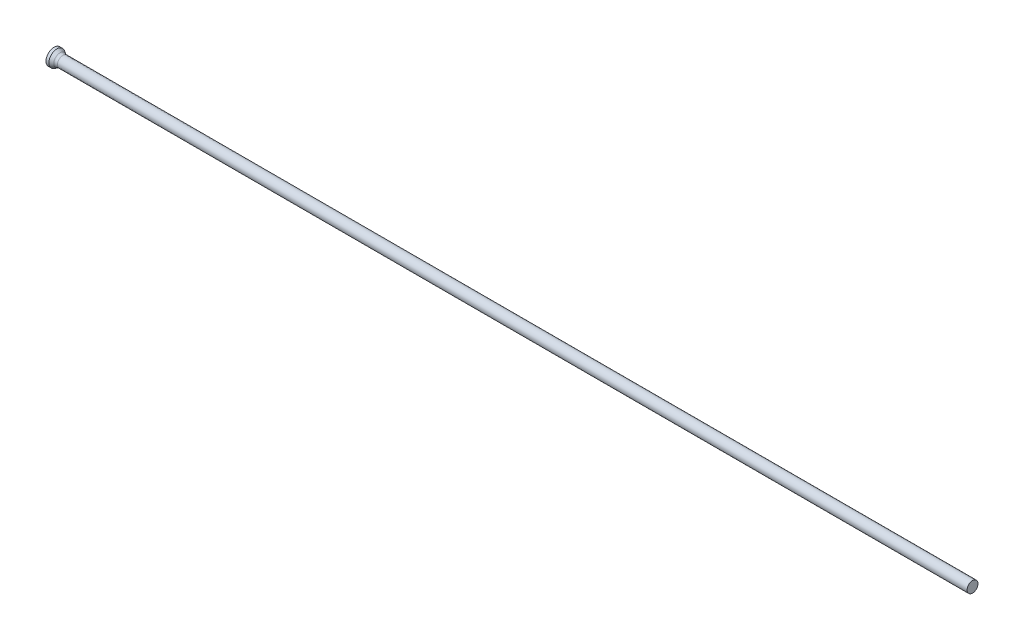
ISO-10303-21;
HEADER;
FILE_DESCRIPTION(('STEP AP214'),'2;1');
FILE_NAME('part.step','',(''),(''),'','','');
FILE_SCHEMA(('AUTOMOTIVE_DESIGN { 1 0 10303 214 1 1 1 1 }'));
ENDSEC;
DATA;
#1=APPLICATION_CONTEXT('core data for automotive mechanical design processes');
#2=APPLICATION_PROTOCOL_DEFINITION('international standard','automotive_design',2000,#1);
#3=PRODUCT_CONTEXT('',#1,'mechanical');
#4=PRODUCT('Part','Part','',(#3));
#5=PRODUCT_RELATED_PRODUCT_CATEGORY('part','',(#4));
#6=PRODUCT_DEFINITION_FORMATION('','',#4);
#7=PRODUCT_DEFINITION_CONTEXT('part definition',#1,'design');
#8=PRODUCT_DEFINITION('design','',#6,#7);
#9=PRODUCT_DEFINITION_SHAPE('','',#8);
#10=(LENGTH_UNIT() NAMED_UNIT(*) SI_UNIT(.MILLI.,.METRE.));
#11=(NAMED_UNIT(*) PLANE_ANGLE_UNIT() SI_UNIT($,.RADIAN.));
#12=(NAMED_UNIT(*) SI_UNIT($,.STERADIAN.) SOLID_ANGLE_UNIT());
#13=UNCERTAINTY_MEASURE_WITH_UNIT(LENGTH_MEASURE(1.E-05),#10,'distance_accuracy_value','');
#14=(GEOMETRIC_REPRESENTATION_CONTEXT(3) GLOBAL_UNCERTAINTY_ASSIGNED_CONTEXT((#13)) GLOBAL_UNIT_ASSIGNED_CONTEXT((#10,
#11,#12)) REPRESENTATION_CONTEXT('',''));
#15=CARTESIAN_POINT('',(0.,0.,0.));
#16=DIRECTION('',(0.,0.,1.));
#17=DIRECTION('',(1.,0.,0.));
#18=AXIS2_PLACEMENT_3D('',#15,#16,#17);
#19=CARTESIAN_POINT('',(0.,0.,0.));
#20=DIRECTION('',(1.,0.,0.));
#21=DIRECTION('',(0.,0.,-1.));
#22=AXIS2_PLACEMENT_3D('',#19,#20,#21);
#23=PLANE('',#22);
#24=CARTESIAN_POINT('',(0.,0.,0.));
#25=DIRECTION('',(-1.,0.,0.));
#26=DIRECTION('',(0.,0.,1.));
#27=AXIS2_PLACEMENT_3D('',#24,#25,#26);
#28=CIRCLE('',#27,1.4);
#29=CARTESIAN_POINT('',(0.,0.,1.4));
#30=VERTEX_POINT('',#29);
#31=EDGE_CURVE('E25',#30,#30,#28,.T.);
#32=ORIENTED_EDGE('',*,*,#31,.T.);
#33=EDGE_LOOP('',(#32));
#34=FACE_BOUND('',#33,.T.);
#35=ADVANCED_FACE('F14',(#34),#23,.F.);
#36=CARTESIAN_POINT('',(0.,0.,0.));
#37=DIRECTION('',(-1.,0.,0.));
#38=DIRECTION('',(0.,0.,1.));
#39=AXIS2_PLACEMENT_3D('',#36,#37,#38);
#40=CYLINDRICAL_SURFACE('',#39,1.4);
#41=ORIENTED_EDGE('',*,*,#31,.F.);
#42=EDGE_LOOP('',(#41));
#43=FACE_BOUND('',#42,.T.);
#44=CARTESIAN_POINT('',(0.500577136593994,0.,0.));
#45=DIRECTION('',(-1.,0.,0.));
#46=DIRECTION('',(0.,0.,1.));
#47=AXIS2_PLACEMENT_3D('',#44,#45,#46);
#48=CIRCLE('',#47,1.4);
#49=CARTESIAN_POINT('',(0.500577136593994,0.,1.4));
#50=VERTEX_POINT('',#49);
#51=EDGE_CURVE('E29',#50,#50,#48,.T.);
#52=ORIENTED_EDGE('',*,*,#51,.T.);
#53=EDGE_LOOP('',(#52));
#54=FACE_BOUND('',#53,.T.);
#55=ADVANCED_FACE('F53',(#43,#54),#40,.T.);
#56=CARTESIAN_POINT('',(1.28,0.,0.));
#57=DIRECTION('',(-1.,0.,0.));
#58=DIRECTION('',(0.,0.,1.));
#59=AXIS2_PLACEMENT_3D('',#56,#57,#58);
#60=CONICAL_SURFACE('',#59,0.95,0.523598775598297);
#61=CARTESIAN_POINT('',(1.04794919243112,0.,0.));
#62=DIRECTION('',(-1.,0.,0.));
#63=DIRECTION('',(0.,0.,1.));
#64=AXIS2_PLACEMENT_3D('',#61,#62,#63);
#65=CIRCLE('',#64,1.08397459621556);
#66=CARTESIAN_POINT('',(1.04794919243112,0.,1.08397459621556));
#67=VERTEX_POINT('',#66);
#68=EDGE_CURVE('E21',#67,#67,#65,.T.);
#69=ORIENTED_EDGE('',*,*,#68,.T.);
#70=EDGE_LOOP('',(#69));
#71=FACE_BOUND('',#70,.T.);
#72=ORIENTED_EDGE('',*,*,#51,.F.);
#73=EDGE_LOOP('',(#72));
#74=FACE_BOUND('',#73,.T.);
#75=ADVANCED_FACE('F50',(#71,#74),#60,.T.);
#76=CARTESIAN_POINT('',(0.,0.,0.));
#77=DIRECTION('',(-1.,0.,0.));
#78=DIRECTION('',(0.,0.,1.));
#79=AXIS2_PLACEMENT_3D('',#76,#77,#78);
#80=CYLINDRICAL_SURFACE('',#79,0.95);
#81=CARTESIAN_POINT('',(1.54794919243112,0.,0.));
#82=DIRECTION('',(-1.,0.,0.));
#83=DIRECTION('',(0.,0.,1.));
#84=AXIS2_PLACEMENT_3D('',#81,#82,#83);
#85=CIRCLE('',#84,0.95);
#86=CARTESIAN_POINT('',(1.54794919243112,0.,0.95));
#87=VERTEX_POINT('',#86);
#88=EDGE_CURVE('E9',#87,#87,#85,.F.);
#89=ORIENTED_EDGE('',*,*,#88,.T.);
#90=EDGE_LOOP('',(#89));
#91=FACE_BOUND('',#90,.T.);
#92=CARTESIAN_POINT('',(160.,0.,0.));
#93=DIRECTION('',(-1.,0.,0.));
#94=DIRECTION('',(0.,0.,1.));
#95=AXIS2_PLACEMENT_3D('',#92,#93,#94);
#96=CIRCLE('',#95,0.95);
#97=CARTESIAN_POINT('',(160.,0.,0.95));
#98=VERTEX_POINT('',#97);
#99=EDGE_CURVE('E34',#98,#98,#96,.T.);
#100=ORIENTED_EDGE('',*,*,#99,.T.);
#101=EDGE_LOOP('',(#100));
#102=FACE_BOUND('',#101,.T.);
#103=ADVANCED_FACE('F38',(#91,#102),#80,.T.);
#104=CARTESIAN_POINT('',(160.,0.95,0.));
#105=DIRECTION('',(-1.,0.,0.));
#106=DIRECTION('',(0.,0.,1.));
#107=AXIS2_PLACEMENT_3D('',#104,#105,#106);
#108=PLANE('',#107);
#109=ORIENTED_EDGE('',*,*,#99,.F.);
#110=EDGE_LOOP('',(#109));
#111=FACE_BOUND('',#110,.T.);
#112=ADVANCED_FACE('F40',(#111),#108,.F.);
#113=CARTESIAN_POINT('',(1.54794919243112,0.,0.));
#114=DIRECTION('',(-1.,0.,0.));
#115=DIRECTION('',(0.,0.,1.));
#116=AXIS2_PLACEMENT_3D('',#113,#114,#115);
#117=TOROIDAL_SURFACE('',#116,1.95,1.);
#118=ORIENTED_EDGE('',*,*,#88,.F.);
#119=EDGE_LOOP('',(#118));
#120=FACE_BOUND('',#119,.T.);
#121=ORIENTED_EDGE('',*,*,#68,.F.);
#122=EDGE_LOOP('',(#121));
#123=FACE_BOUND('',#122,.T.);
#124=ADVANCED_FACE('F16',(#120,#123),#117,.F.);
#125=CLOSED_SHELL('',(#35,#55,#75,#103,#112,#124));
#126=MANIFOLD_SOLID_BREP('B1',#125);
#127=ADVANCED_BREP_SHAPE_REPRESENTATION('',(#18,#126),#14);
#128=SHAPE_DEFINITION_REPRESENTATION(#9,#127);
ENDSEC;
END-ISO-10303-21;
